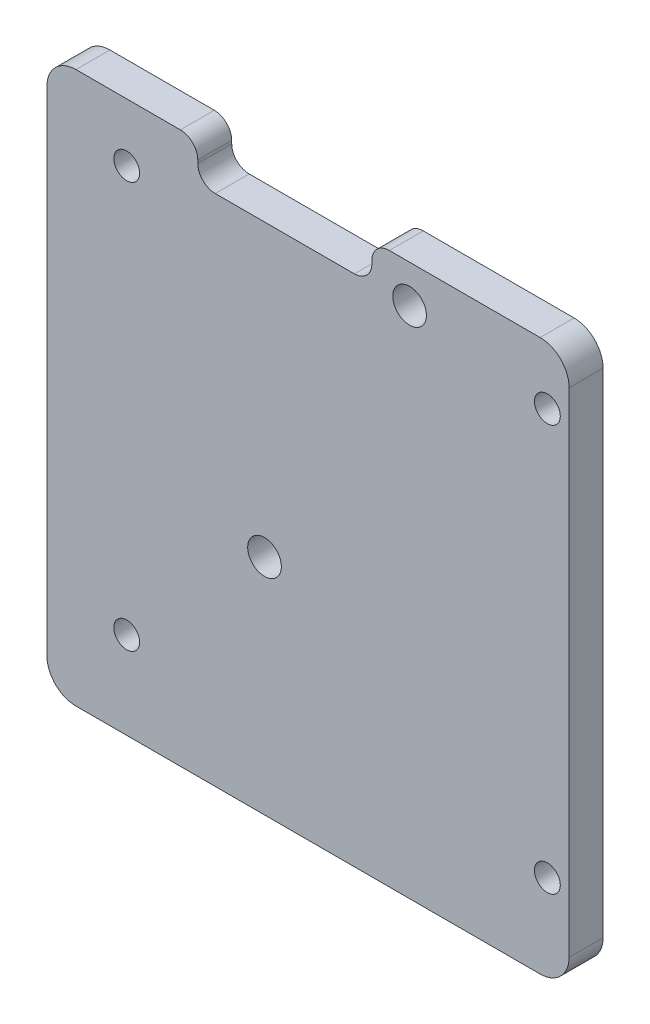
ISO-10303-21;
HEADER;
FILE_DESCRIPTION(('STEP AP214'),'2;1');
FILE_NAME('part.step','',(''),(''),'','','');
FILE_SCHEMA(('AUTOMOTIVE_DESIGN { 1 0 10303 214 1 1 1 1 }'));
ENDSEC;
DATA;
#1=APPLICATION_CONTEXT('core data for automotive mechanical design processes');
#2=APPLICATION_PROTOCOL_DEFINITION('international standard','automotive_design',2000,#1);
#3=PRODUCT_CONTEXT('',#1,'mechanical');
#4=PRODUCT('Part','Part','',(#3));
#5=PRODUCT_RELATED_PRODUCT_CATEGORY('part','',(#4));
#6=PRODUCT_DEFINITION_FORMATION('','',#4);
#7=PRODUCT_DEFINITION_CONTEXT('part definition',#1,'design');
#8=PRODUCT_DEFINITION('design','',#6,#7);
#9=PRODUCT_DEFINITION_SHAPE('','',#8);
#10=(LENGTH_UNIT() NAMED_UNIT(*) SI_UNIT(.MILLI.,.METRE.));
#11=(NAMED_UNIT(*) PLANE_ANGLE_UNIT() SI_UNIT($,.RADIAN.));
#12=(NAMED_UNIT(*) SI_UNIT($,.STERADIAN.) SOLID_ANGLE_UNIT());
#13=UNCERTAINTY_MEASURE_WITH_UNIT(LENGTH_MEASURE(1.E-05),#10,'distance_accuracy_value','');
#14=(GEOMETRIC_REPRESENTATION_CONTEXT(3) GLOBAL_UNCERTAINTY_ASSIGNED_CONTEXT((#13)) GLOBAL_UNIT_ASSIGNED_CONTEXT((#10,
#11,#12)) REPRESENTATION_CONTEXT('',''));
#15=CARTESIAN_POINT('',(0.,0.,0.));
#16=DIRECTION('',(0.,0.,1.));
#17=DIRECTION('',(1.,0.,0.));
#18=AXIS2_PLACEMENT_3D('',#15,#16,#17);
#19=CARTESIAN_POINT('',(-22.86,24.13,2.9718));
#20=DIRECTION('',(0.,-1.,0.));
#21=DIRECTION('',(0.,0.,-1.));
#22=AXIS2_PLACEMENT_3D('',#19,#20,#21);
#23=PLANE('',#22);
#24=DIRECTION('',(-1.,0.,0.));
#25=VECTOR('',#24,1.);
#26=CARTESIAN_POINT('',(-22.86,24.13,0.));
#27=LINE('',#26,#25);
#28=CARTESIAN_POINT('',(-11.176,24.13,0.));
#29=VERTEX_POINT('',#28);
#30=CARTESIAN_POINT('',(-20.32,24.13,0.));
#31=VERTEX_POINT('',#30);
#32=EDGE_CURVE('E163',#29,#31,#27,.T.);
#33=ORIENTED_EDGE('',*,*,#32,.T.);
#34=DIRECTION('',(0.,0.,-1.));
#35=VECTOR('',#34,1.);
#36=CARTESIAN_POINT('',(-20.32,24.13,2.9718));
#37=LINE('',#36,#35);
#38=CARTESIAN_POINT('',(-20.32,24.13,2.9718));
#39=VERTEX_POINT('',#38);
#40=EDGE_CURVE('E47',#31,#39,#37,.F.);
#41=ORIENTED_EDGE('',*,*,#40,.T.);
#42=DIRECTION('',(-1.,0.,0.));
#43=VECTOR('',#42,1.);
#44=CARTESIAN_POINT('',(-22.86,24.13,2.9718));
#45=LINE('',#44,#43);
#46=CARTESIAN_POINT('',(-11.176,24.13,2.9718));
#47=VERTEX_POINT('',#46);
#48=EDGE_CURVE('E248',#47,#39,#45,.T.);
#49=ORIENTED_EDGE('',*,*,#48,.F.);
#50=DIRECTION('',(0.,0.,-1.));
#51=VECTOR('',#50,1.);
#52=CARTESIAN_POINT('',(-11.176,24.13,2.9718));
#53=LINE('',#52,#51);
#54=EDGE_CURVE('E175',#47,#29,#53,.T.);
#55=ORIENTED_EDGE('',*,*,#54,.T.);
#56=EDGE_LOOP('',(#33,#41,#49,#55));
#57=FACE_BOUND('',#56,.T.);
#58=ADVANCED_FACE('F39',(#57),#23,.F.);
#59=CARTESIAN_POINT('',(22.86,24.13,2.9718));
#60=DIRECTION('',(-1.,0.,0.));
#61=DIRECTION('',(0.,-1.,0.));
#62=AXIS2_PLACEMENT_3D('',#59,#60,#61);
#63=PLANE('',#62);
#64=DIRECTION('',(0.,1.,0.));
#65=VECTOR('',#64,1.);
#66=CARTESIAN_POINT('',(22.86,24.13,2.9718));
#67=LINE('',#66,#65);
#68=CARTESIAN_POINT('',(22.86,-21.59,2.9718));
#69=VERTEX_POINT('',#68);
#70=CARTESIAN_POINT('',(22.86,21.59,2.9718));
#71=VERTEX_POINT('',#70);
#72=EDGE_CURVE('E258',#69,#71,#67,.T.);
#73=ORIENTED_EDGE('',*,*,#72,.F.);
#74=DIRECTION('',(0.,0.,-1.));
#75=VECTOR('',#74,1.);
#76=CARTESIAN_POINT('',(22.86,-21.59,2.9718));
#77=LINE('',#76,#75);
#78=CARTESIAN_POINT('',(22.86,-21.59,0.));
#79=VERTEX_POINT('',#78);
#80=EDGE_CURVE('E218',#69,#79,#77,.T.);
#81=ORIENTED_EDGE('',*,*,#80,.T.);
#82=DIRECTION('',(0.,1.,0.));
#83=VECTOR('',#82,1.);
#84=CARTESIAN_POINT('',(22.86,24.13,0.));
#85=LINE('',#84,#83);
#86=CARTESIAN_POINT('',(22.86,21.59,0.));
#87=VERTEX_POINT('',#86);
#88=EDGE_CURVE('E270',#79,#87,#85,.T.);
#89=ORIENTED_EDGE('',*,*,#88,.T.);
#90=DIRECTION('',(0.,0.,-1.));
#91=VECTOR('',#90,1.);
#92=CARTESIAN_POINT('',(22.86,21.59,2.9718));
#93=LINE('',#92,#91);
#94=EDGE_CURVE('E216',#87,#71,#93,.F.);
#95=ORIENTED_EDGE('',*,*,#94,.T.);
#96=EDGE_LOOP('',(#73,#81,#89,#95));
#97=FACE_BOUND('',#96,.T.);
#98=ADVANCED_FACE('F358',(#97),#63,.F.);
#99=CARTESIAN_POINT('',(20.32,24.13,2.9718));
#100=VERTEX_POINT('',#99);
#101=CARTESIAN_POINT('',(7.11200000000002,24.13,2.9718));
#102=VERTEX_POINT('',#101);
#103=EDGE_CURVE('E257',#100,#102,#45,.T.);
#104=ORIENTED_EDGE('',*,*,#103,.F.);
#105=DIRECTION('',(0.,0.,-1.));
#106=VECTOR('',#105,1.);
#107=CARTESIAN_POINT('',(20.32,24.13,2.9718));
#108=LINE('',#107,#106);
#109=CARTESIAN_POINT('',(20.32,24.13,0.));
#110=VERTEX_POINT('',#109);
#111=EDGE_CURVE('E11',#100,#110,#108,.T.);
#112=ORIENTED_EDGE('',*,*,#111,.T.);
#113=CARTESIAN_POINT('',(7.11200000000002,24.13,0.));
#114=VERTEX_POINT('',#113);
#115=EDGE_CURVE('E154',#110,#114,#27,.T.);
#116=ORIENTED_EDGE('',*,*,#115,.T.);
#117=DIRECTION('',(0.,0.,1.));
#118=VECTOR('',#117,1.);
#119=CARTESIAN_POINT('',(7.11200000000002,24.13,2.9718));
#120=LINE('',#119,#118);
#121=EDGE_CURVE('E159',#114,#102,#120,.T.);
#122=ORIENTED_EDGE('',*,*,#121,.T.);
#123=EDGE_LOOP('',(#104,#112,#116,#122));
#124=FACE_BOUND('',#123,.T.);
#125=ADVANCED_FACE('F157',(#124),#23,.F.);
#126=CARTESIAN_POINT('',(-22.86,24.13,2.9718));
#127=DIRECTION('',(1.,0.,0.));
#128=DIRECTION('',(0.,1.,0.));
#129=AXIS2_PLACEMENT_3D('',#126,#127,#128);
#130=PLANE('',#129);
#131=DIRECTION('',(0.,-1.,0.));
#132=VECTOR('',#131,1.);
#133=CARTESIAN_POINT('',(-22.86,24.13,0.));
#134=LINE('',#133,#132);
#135=CARTESIAN_POINT('',(-22.86,21.59,0.));
#136=VERTEX_POINT('',#135);
#137=CARTESIAN_POINT('',(-22.86,-21.59,0.));
#138=VERTEX_POINT('',#137);
#139=EDGE_CURVE('E162',#136,#138,#134,.T.);
#140=ORIENTED_EDGE('',*,*,#139,.T.);
#141=DIRECTION('',(0.,0.,-1.));
#142=VECTOR('',#141,1.);
#143=CARTESIAN_POINT('',(-22.86,-21.59,2.9718));
#144=LINE('',#143,#142);
#145=CARTESIAN_POINT('',(-22.86,-21.59,2.9718));
#146=VERTEX_POINT('',#145);
#147=EDGE_CURVE('E54',#138,#146,#144,.F.);
#148=ORIENTED_EDGE('',*,*,#147,.T.);
#149=DIRECTION('',(0.,-1.,0.));
#150=VECTOR('',#149,1.);
#151=CARTESIAN_POINT('',(-22.86,24.13,2.9718));
#152=LINE('',#151,#150);
#153=CARTESIAN_POINT('',(-22.86,21.59,2.9718));
#154=VERTEX_POINT('',#153);
#155=EDGE_CURVE('E264',#154,#146,#152,.T.);
#156=ORIENTED_EDGE('',*,*,#155,.F.);
#157=DIRECTION('',(0.,0.,-1.));
#158=VECTOR('',#157,1.);
#159=CARTESIAN_POINT('',(-22.86,21.59,2.9718));
#160=LINE('',#159,#158);
#161=EDGE_CURVE('E241',#154,#136,#160,.T.);
#162=ORIENTED_EDGE('',*,*,#161,.T.);
#163=EDGE_LOOP('',(#140,#148,#156,#162));
#164=FACE_BOUND('',#163,.T.);
#165=ADVANCED_FACE('F263',(#164),#130,.F.);
#166=CARTESIAN_POINT('',(-22.86,-24.13,2.9718));
#167=DIRECTION('',(0.,1.,0.));
#168=DIRECTION('',(0.,0.,1.));
#169=AXIS2_PLACEMENT_3D('',#166,#167,#168);
#170=PLANE('',#169);
#171=DIRECTION('',(1.,0.,0.));
#172=VECTOR('',#171,1.);
#173=CARTESIAN_POINT('',(-22.86,-24.13,0.));
#174=LINE('',#173,#172);
#175=CARTESIAN_POINT('',(-20.32,-24.13,0.));
#176=VERTEX_POINT('',#175);
#177=CARTESIAN_POINT('',(20.32,-24.13,0.));
#178=VERTEX_POINT('',#177);
#179=EDGE_CURVE('E266',#176,#178,#174,.T.);
#180=ORIENTED_EDGE('',*,*,#179,.T.);
#181=DIRECTION('',(0.,0.,-1.));
#182=VECTOR('',#181,1.);
#183=CARTESIAN_POINT('',(20.32,-24.13,2.9718));
#184=LINE('',#183,#182);
#185=CARTESIAN_POINT('',(20.32,-24.13,2.9718));
#186=VERTEX_POINT('',#185);
#187=EDGE_CURVE('E232',#178,#186,#184,.F.);
#188=ORIENTED_EDGE('',*,*,#187,.T.);
#189=DIRECTION('',(1.,0.,0.));
#190=VECTOR('',#189,1.);
#191=CARTESIAN_POINT('',(-22.86,-24.13,2.9718));
#192=LINE('',#191,#190);
#193=CARTESIAN_POINT('',(-20.32,-24.13,2.9718));
#194=VERTEX_POINT('',#193);
#195=EDGE_CURVE('E186',#194,#186,#192,.T.);
#196=ORIENTED_EDGE('',*,*,#195,.F.);
#197=DIRECTION('',(0.,0.,-1.));
#198=VECTOR('',#197,1.);
#199=CARTESIAN_POINT('',(-20.32,-24.13,2.9718));
#200=LINE('',#199,#198);
#201=EDGE_CURVE('E229',#194,#176,#200,.T.);
#202=ORIENTED_EDGE('',*,*,#201,.T.);
#203=EDGE_LOOP('',(#180,#188,#196,#202));
#204=FACE_BOUND('',#203,.T.);
#205=ADVANCED_FACE('F331',(#204),#170,.F.);
#206=CARTESIAN_POINT('',(0.,0.,2.9718));
#207=DIRECTION('',(0.,0.,1.));
#208=DIRECTION('',(1.,0.,0.));
#209=AXIS2_PLACEMENT_3D('',#206,#207,#208);
#210=PLANE('',#209);
#211=CARTESIAN_POINT('',(-15.875,19.05,2.9718));
#212=DIRECTION('',(0.,0.,1.));
#213=DIRECTION('',(1.,0.,0.));
#214=AXIS2_PLACEMENT_3D('',#211,#212,#213);
#215=CIRCLE('',#214,1.13029999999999);
#216=CARTESIAN_POINT('',(-14.7447,19.05,2.9718));
#217=VERTEX_POINT('',#216);
#218=EDGE_CURVE('E323',#217,#217,#215,.T.);
#219=ORIENTED_EDGE('',*,*,#218,.F.);
#220=EDGE_LOOP('',(#219));
#221=FACE_BOUND('',#220,.T.);
#222=CARTESIAN_POINT('',(20.955,19.05,2.9718));
#223=DIRECTION('',(0.,0.,1.));
#224=DIRECTION('',(1.,0.,0.));
#225=AXIS2_PLACEMENT_3D('',#222,#223,#224);
#226=CIRCLE('',#225,1.13029999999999);
#227=CARTESIAN_POINT('',(22.0853,19.05,2.9718));
#228=VERTEX_POINT('',#227);
#229=EDGE_CURVE('E317',#228,#228,#226,.T.);
#230=ORIENTED_EDGE('',*,*,#229,.F.);
#231=EDGE_LOOP('',(#230));
#232=FACE_BOUND('',#231,.T.);
#233=CARTESIAN_POINT('',(-15.875,-16.51,2.9718));
#234=DIRECTION('',(0.,0.,1.));
#235=DIRECTION('',(1.,0.,0.));
#236=AXIS2_PLACEMENT_3D('',#233,#234,#235);
#237=CIRCLE('',#236,1.13029999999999);
#238=CARTESIAN_POINT('',(-14.7447,-16.51,2.9718));
#239=VERTEX_POINT('',#238);
#240=EDGE_CURVE('E311',#239,#239,#237,.T.);
#241=ORIENTED_EDGE('',*,*,#240,.F.);
#242=EDGE_LOOP('',(#241));
#243=FACE_BOUND('',#242,.T.);
#244=CARTESIAN_POINT('',(20.955,-16.51,2.9718));
#245=DIRECTION('',(0.,0.,1.));
#246=DIRECTION('',(1.,0.,0.));
#247=AXIS2_PLACEMENT_3D('',#244,#245,#246);
#248=CIRCLE('',#247,1.13029999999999);
#249=CARTESIAN_POINT('',(22.0853,-16.51,2.9718));
#250=VERTEX_POINT('',#249);
#251=EDGE_CURVE('E305',#250,#250,#248,.T.);
#252=ORIENTED_EDGE('',*,*,#251,.F.);
#253=EDGE_LOOP('',(#252));
#254=FACE_BOUND('',#253,.T.);
#255=ORIENTED_EDGE('',*,*,#195,.T.);
#256=CARTESIAN_POINT('',(20.32,-21.59,2.9718));
#257=DIRECTION('',(0.,0.,1.));
#258=DIRECTION('',(1.,0.,0.));
#259=AXIS2_PLACEMENT_3D('',#256,#257,#258);
#260=CIRCLE('',#259,2.54);
#261=EDGE_CURVE('E239',#186,#69,#260,.T.);
#262=ORIENTED_EDGE('',*,*,#261,.T.);
#263=ORIENTED_EDGE('',*,*,#72,.T.);
#264=CARTESIAN_POINT('',(20.32,21.59,2.9718));
#265=DIRECTION('',(0.,0.,1.));
#266=DIRECTION('',(1.,0.,0.));
#267=AXIS2_PLACEMENT_3D('',#264,#265,#266);
#268=CIRCLE('',#267,2.54);
#269=EDGE_CURVE('E234',#71,#100,#268,.T.);
#270=ORIENTED_EDGE('',*,*,#269,.T.);
#271=ORIENTED_EDGE('',*,*,#103,.T.);
#272=CARTESIAN_POINT('',(7.11200000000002,22.606,2.9718));
#273=DIRECTION('',(0.,0.,1.));
#274=DIRECTION('',(1.,0.,0.));
#275=AXIS2_PLACEMENT_3D('',#272,#273,#274);
#276=CIRCLE('',#275,1.524);
#277=CARTESIAN_POINT('',(5.58800000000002,22.606,2.9718));
#278=VERTEX_POINT('',#277);
#279=EDGE_CURVE('E180',#102,#278,#276,.T.);
#280=ORIENTED_EDGE('',*,*,#279,.T.);
#281=DIRECTION('',(0.,1.,0.));
#282=VECTOR('',#281,1.);
#283=CARTESIAN_POINT('',(5.58800000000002,27.432,2.9718));
#284=LINE('',#283,#282);
#285=CARTESIAN_POINT('',(5.58800000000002,22.352,2.9718));
#286=VERTEX_POINT('',#285);
#287=EDGE_CURVE('E289',#286,#278,#284,.T.);
#288=ORIENTED_EDGE('',*,*,#287,.F.);
#289=CARTESIAN_POINT('',(4.06400000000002,22.352,2.9718));
#290=DIRECTION('',(0.,0.,1.));
#291=DIRECTION('',(1.,0.,0.));
#292=AXIS2_PLACEMENT_3D('',#289,#290,#291);
#293=CIRCLE('',#292,1.524);
#294=CARTESIAN_POINT('',(4.06400000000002,20.828,2.9718));
#295=VERTEX_POINT('',#294);
#296=EDGE_CURVE('E212',#286,#295,#293,.F.);
#297=ORIENTED_EDGE('',*,*,#296,.T.);
#298=DIRECTION('',(1.,0.,0.));
#299=VECTOR('',#298,1.);
#300=CARTESIAN_POINT('',(5.58800000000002,20.828,2.9718));
#301=LINE('',#300,#299);
#302=CARTESIAN_POINT('',(-8.12799999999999,20.828,2.9718));
#303=VERTEX_POINT('',#302);
#304=EDGE_CURVE('E293',#303,#295,#301,.T.);
#305=ORIENTED_EDGE('',*,*,#304,.F.);
#306=CARTESIAN_POINT('',(-8.12799999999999,22.352,2.9718));
#307=DIRECTION('',(0.,0.,1.));
#308=DIRECTION('',(1.,0.,0.));
#309=AXIS2_PLACEMENT_3D('',#306,#307,#308);
#310=CIRCLE('',#309,1.524);
#311=CARTESIAN_POINT('',(-9.65199999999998,22.352,2.9718));
#312=VERTEX_POINT('',#311);
#313=EDGE_CURVE('E208',#303,#312,#310,.F.);
#314=ORIENTED_EDGE('',*,*,#313,.T.);
#315=DIRECTION('',(0.,-1.,0.));
#316=VECTOR('',#315,1.);
#317=CARTESIAN_POINT('',(-9.65199999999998,27.432,2.9718));
#318=LINE('',#317,#316);
#319=CARTESIAN_POINT('',(-9.65199999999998,22.606,2.9718));
#320=VERTEX_POINT('',#319);
#321=EDGE_CURVE('E296',#320,#312,#318,.T.);
#322=ORIENTED_EDGE('',*,*,#321,.F.);
#323=CARTESIAN_POINT('',(-11.176,22.606,2.9718));
#324=DIRECTION('',(0.,0.,1.));
#325=DIRECTION('',(1.,0.,0.));
#326=AXIS2_PLACEMENT_3D('',#323,#324,#325);
#327=CIRCLE('',#326,1.524);
#328=EDGE_CURVE('E181',#320,#47,#327,.T.);
#329=ORIENTED_EDGE('',*,*,#328,.T.);
#330=ORIENTED_EDGE('',*,*,#48,.T.);
#331=CARTESIAN_POINT('',(-20.32,21.59,2.9718));
#332=DIRECTION('',(0.,0.,1.));
#333=DIRECTION('',(1.,0.,0.));
#334=AXIS2_PLACEMENT_3D('',#331,#332,#333);
#335=CIRCLE('',#334,2.54);
#336=EDGE_CURVE('E61',#39,#154,#335,.T.);
#337=ORIENTED_EDGE('',*,*,#336,.T.);
#338=ORIENTED_EDGE('',*,*,#155,.T.);
#339=CARTESIAN_POINT('',(-20.32,-21.59,2.9718));
#340=DIRECTION('',(0.,0.,1.));
#341=DIRECTION('',(1.,0.,0.));
#342=AXIS2_PLACEMENT_3D('',#339,#340,#341);
#343=CIRCLE('',#342,2.54);
#344=EDGE_CURVE('E237',#146,#194,#343,.T.);
#345=ORIENTED_EDGE('',*,*,#344,.T.);
#346=EDGE_LOOP('',(#255,#262,#263,#270,#271,#280,#288,#297,#305,#314,#322,#329,#330,#337,#338,#345));
#347=FACE_BOUND('',#346,.T.);
#348=CARTESIAN_POINT('',(8.89,20.828,2.9718));
#349=DIRECTION('',(0.,0.,1.));
#350=DIRECTION('',(1.,0.,0.));
#351=AXIS2_PLACEMENT_3D('',#348,#349,#350);
#352=CIRCLE('',#351,1.4732);
#353=CARTESIAN_POINT('',(10.3632,20.828,2.9718));
#354=VERTEX_POINT('',#353);
#355=EDGE_CURVE('E286',#354,#354,#352,.T.);
#356=ORIENTED_EDGE('',*,*,#355,.F.);
#357=EDGE_LOOP('',(#356));
#358=FACE_BOUND('',#357,.T.);
#359=CARTESIAN_POINT('',(-3.80999999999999,-4.572,2.9718));
#360=DIRECTION('',(0.,0.,1.));
#361=DIRECTION('',(1.,0.,0.));
#362=AXIS2_PLACEMENT_3D('',#359,#360,#361);
#363=CIRCLE('',#362,1.4732);
#364=CARTESIAN_POINT('',(-2.33679999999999,-4.572,2.9718));
#365=VERTEX_POINT('',#364);
#366=EDGE_CURVE('E280',#365,#365,#363,.T.);
#367=ORIENTED_EDGE('',*,*,#366,.F.);
#368=EDGE_LOOP('',(#367));
#369=FACE_BOUND('',#368,.T.);
#370=ADVANCED_FACE('F253',(#221,#232,#243,#254,#347,#358,#369),#210,.T.);
#371=CARTESIAN_POINT('',(0.,0.,0.));
#372=DIRECTION('',(0.,0.,1.));
#373=DIRECTION('',(1.,0.,0.));
#374=AXIS2_PLACEMENT_3D('',#371,#372,#373);
#375=PLANE('',#374);
#376=CARTESIAN_POINT('',(-15.875,19.05,0.));
#377=DIRECTION('',(0.,0.,1.));
#378=DIRECTION('',(1.,0.,0.));
#379=AXIS2_PLACEMENT_3D('',#376,#377,#378);
#380=CIRCLE('',#379,1.1303);
#381=CARTESIAN_POINT('',(-14.7447,19.05,0.));
#382=VERTEX_POINT('',#381);
#383=EDGE_CURVE('E320',#382,#382,#380,.T.);
#384=ORIENTED_EDGE('',*,*,#383,.T.);
#385=EDGE_LOOP('',(#384));
#386=FACE_BOUND('',#385,.T.);
#387=CARTESIAN_POINT('',(20.955,19.05,0.));
#388=DIRECTION('',(0.,0.,1.));
#389=DIRECTION('',(1.,0.,0.));
#390=AXIS2_PLACEMENT_3D('',#387,#388,#389);
#391=CIRCLE('',#390,1.1303);
#392=CARTESIAN_POINT('',(22.0853,19.05,0.));
#393=VERTEX_POINT('',#392);
#394=EDGE_CURVE('E314',#393,#393,#391,.T.);
#395=ORIENTED_EDGE('',*,*,#394,.T.);
#396=EDGE_LOOP('',(#395));
#397=FACE_BOUND('',#396,.T.);
#398=CARTESIAN_POINT('',(-15.875,-16.51,0.));
#399=DIRECTION('',(0.,0.,1.));
#400=DIRECTION('',(1.,0.,0.));
#401=AXIS2_PLACEMENT_3D('',#398,#399,#400);
#402=CIRCLE('',#401,1.1303);
#403=CARTESIAN_POINT('',(-14.7447,-16.51,0.));
#404=VERTEX_POINT('',#403);
#405=EDGE_CURVE('E308',#404,#404,#402,.T.);
#406=ORIENTED_EDGE('',*,*,#405,.T.);
#407=EDGE_LOOP('',(#406));
#408=FACE_BOUND('',#407,.T.);
#409=CARTESIAN_POINT('',(20.955,-16.51,0.));
#410=DIRECTION('',(0.,0.,1.));
#411=DIRECTION('',(1.,0.,0.));
#412=AXIS2_PLACEMENT_3D('',#409,#410,#411);
#413=CIRCLE('',#412,1.1303);
#414=CARTESIAN_POINT('',(22.0853,-16.51,0.));
#415=VERTEX_POINT('',#414);
#416=EDGE_CURVE('E299',#415,#415,#413,.T.);
#417=ORIENTED_EDGE('',*,*,#416,.T.);
#418=EDGE_LOOP('',(#417));
#419=FACE_BOUND('',#418,.T.);
#420=ORIENTED_EDGE('',*,*,#88,.F.);
#421=CARTESIAN_POINT('',(20.32,-21.59,0.));
#422=DIRECTION('',(0.,0.,1.));
#423=DIRECTION('',(1.,0.,0.));
#424=AXIS2_PLACEMENT_3D('',#421,#422,#423);
#425=CIRCLE('',#424,2.54);
#426=EDGE_CURVE('E227',#79,#178,#425,.F.);
#427=ORIENTED_EDGE('',*,*,#426,.T.);
#428=ORIENTED_EDGE('',*,*,#179,.F.);
#429=CARTESIAN_POINT('',(-20.32,-21.59,0.));
#430=DIRECTION('',(0.,0.,1.));
#431=DIRECTION('',(1.,0.,0.));
#432=AXIS2_PLACEMENT_3D('',#429,#430,#431);
#433=CIRCLE('',#432,2.54);
#434=EDGE_CURVE('E225',#176,#138,#433,.F.);
#435=ORIENTED_EDGE('',*,*,#434,.T.);
#436=ORIENTED_EDGE('',*,*,#139,.F.);
#437=CARTESIAN_POINT('',(-20.32,21.59,0.));
#438=DIRECTION('',(0.,0.,1.));
#439=DIRECTION('',(1.,0.,0.));
#440=AXIS2_PLACEMENT_3D('',#437,#438,#439);
#441=CIRCLE('',#440,2.54);
#442=EDGE_CURVE('E223',#136,#31,#441,.F.);
#443=ORIENTED_EDGE('',*,*,#442,.T.);
#444=ORIENTED_EDGE('',*,*,#32,.F.);
#445=CARTESIAN_POINT('',(-11.176,22.606,0.));
#446=DIRECTION('',(0.,0.,1.));
#447=DIRECTION('',(1.,0.,0.));
#448=AXIS2_PLACEMENT_3D('',#445,#446,#447);
#449=CIRCLE('',#448,1.524);
#450=CARTESIAN_POINT('',(-9.65199999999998,22.606,0.));
#451=VERTEX_POINT('',#450);
#452=EDGE_CURVE('E176',#29,#451,#449,.F.);
#453=ORIENTED_EDGE('',*,*,#452,.T.);
#454=DIRECTION('',(0.,-1.,0.));
#455=VECTOR('',#454,1.);
#456=CARTESIAN_POINT('',(-9.65199999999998,0.,0.));
#457=LINE('',#456,#455);
#458=CARTESIAN_POINT('',(-9.65199999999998,22.352,0.));
#459=VERTEX_POINT('',#458);
#460=EDGE_CURVE('E182',#451,#459,#457,.T.);
#461=ORIENTED_EDGE('',*,*,#460,.T.);
#462=CARTESIAN_POINT('',(-8.12799999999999,22.352,0.));
#463=DIRECTION('',(0.,0.,1.));
#464=DIRECTION('',(1.,0.,0.));
#465=AXIS2_PLACEMENT_3D('',#462,#463,#464);
#466=CIRCLE('',#465,1.524);
#467=CARTESIAN_POINT('',(-8.12799999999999,20.828,0.));
#468=VERTEX_POINT('',#467);
#469=EDGE_CURVE('E210',#459,#468,#466,.T.);
#470=ORIENTED_EDGE('',*,*,#469,.T.);
#471=DIRECTION('',(1.,0.,0.));
#472=VECTOR('',#471,1.);
#473=CARTESIAN_POINT('',(5.58800000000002,20.828,0.));
#474=LINE('',#473,#472);
#475=CARTESIAN_POINT('',(4.06400000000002,20.828,0.));
#476=VERTEX_POINT('',#475);
#477=EDGE_CURVE('E292',#468,#476,#474,.T.);
#478=ORIENTED_EDGE('',*,*,#477,.T.);
#479=CARTESIAN_POINT('',(4.06400000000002,22.352,0.));
#480=DIRECTION('',(0.,0.,1.));
#481=DIRECTION('',(1.,0.,0.));
#482=AXIS2_PLACEMENT_3D('',#479,#480,#481);
#483=CIRCLE('',#482,1.524);
#484=CARTESIAN_POINT('',(5.58800000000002,22.352,0.));
#485=VERTEX_POINT('',#484);
#486=EDGE_CURVE('E214',#476,#485,#483,.T.);
#487=ORIENTED_EDGE('',*,*,#486,.T.);
#488=DIRECTION('',(0.,1.,0.));
#489=VECTOR('',#488,1.);
#490=CARTESIAN_POINT('',(5.58800000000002,27.432,0.));
#491=LINE('',#490,#489);
#492=CARTESIAN_POINT('',(5.58800000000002,22.606,0.));
#493=VERTEX_POINT('',#492);
#494=EDGE_CURVE('E172',#485,#493,#491,.T.);
#495=ORIENTED_EDGE('',*,*,#494,.T.);
#496=CARTESIAN_POINT('',(7.11200000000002,22.606,0.));
#497=DIRECTION('',(0.,0.,1.));
#498=DIRECTION('',(1.,0.,0.));
#499=AXIS2_PLACEMENT_3D('',#496,#497,#498);
#500=CIRCLE('',#499,1.524);
#501=EDGE_CURVE('E167',#493,#114,#500,.F.);
#502=ORIENTED_EDGE('',*,*,#501,.T.);
#503=ORIENTED_EDGE('',*,*,#115,.F.);
#504=CARTESIAN_POINT('',(20.32,21.59,0.));
#505=DIRECTION('',(0.,0.,1.));
#506=DIRECTION('',(1.,0.,0.));
#507=AXIS2_PLACEMENT_3D('',#504,#505,#506);
#508=CIRCLE('',#507,2.54);
#509=EDGE_CURVE('E221',#110,#87,#508,.F.);
#510=ORIENTED_EDGE('',*,*,#509,.T.);
#511=EDGE_LOOP('',(#420,#427,#428,#435,#436,#443,#444,#453,#461,#470,#478,#487,#495,#502,#503,#510));
#512=FACE_BOUND('',#511,.T.);
#513=CARTESIAN_POINT('',(8.89,20.828,0.));
#514=DIRECTION('',(0.,0.,1.));
#515=DIRECTION('',(1.,0.,0.));
#516=AXIS2_PLACEMENT_3D('',#513,#514,#515);
#517=CIRCLE('',#516,1.4732);
#518=CARTESIAN_POINT('',(10.3632,20.828,0.));
#519=VERTEX_POINT('',#518);
#520=EDGE_CURVE('E283',#519,#519,#517,.T.);
#521=ORIENTED_EDGE('',*,*,#520,.T.);
#522=EDGE_LOOP('',(#521));
#523=FACE_BOUND('',#522,.T.);
#524=CARTESIAN_POINT('',(-3.80999999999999,-4.572,0.));
#525=DIRECTION('',(0.,0.,1.));
#526=DIRECTION('',(1.,0.,0.));
#527=AXIS2_PLACEMENT_3D('',#524,#525,#526);
#528=CIRCLE('',#527,1.4732);
#529=CARTESIAN_POINT('',(-2.33679999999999,-4.572,0.));
#530=VERTEX_POINT('',#529);
#531=EDGE_CURVE('E273',#530,#530,#528,.T.);
#532=ORIENTED_EDGE('',*,*,#531,.T.);
#533=EDGE_LOOP('',(#532));
#534=FACE_BOUND('',#533,.T.);
#535=ADVANCED_FACE('F169',(#386,#397,#408,#419,#512,#523,#534),#375,.F.);
#536=CARTESIAN_POINT('',(-3.80999999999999,-4.572,2.9718));
#537=DIRECTION('',(0.,0.,1.));
#538=DIRECTION('',(1.,0.,0.));
#539=AXIS2_PLACEMENT_3D('',#536,#537,#538);
#540=CYLINDRICAL_SURFACE('',#539,1.4732);
#541=ORIENTED_EDGE('',*,*,#531,.F.);
#542=EDGE_LOOP('',(#541));
#543=FACE_BOUND('',#542,.T.);
#544=ORIENTED_EDGE('',*,*,#366,.T.);
#545=EDGE_LOOP('',(#544));
#546=FACE_BOUND('',#545,.T.);
#547=ADVANCED_FACE('F377',(#543,#546),#540,.F.);
#548=CARTESIAN_POINT('',(8.89,20.828,2.9718));
#549=DIRECTION('',(0.,0.,1.));
#550=DIRECTION('',(1.,0.,0.));
#551=AXIS2_PLACEMENT_3D('',#548,#549,#550);
#552=CYLINDRICAL_SURFACE('',#551,1.4732);
#553=ORIENTED_EDGE('',*,*,#520,.F.);
#554=EDGE_LOOP('',(#553));
#555=FACE_BOUND('',#554,.T.);
#556=ORIENTED_EDGE('',*,*,#355,.T.);
#557=EDGE_LOOP('',(#556));
#558=FACE_BOUND('',#557,.T.);
#559=ADVANCED_FACE('F382',(#555,#558),#552,.F.);
#560=CARTESIAN_POINT('',(-9.65199999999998,27.432,0.));
#561=DIRECTION('',(-1.,0.,0.));
#562=DIRECTION('',(0.,0.,1.));
#563=AXIS2_PLACEMENT_3D('',#560,#561,#562);
#564=PLANE('',#563);
#565=ORIENTED_EDGE('',*,*,#460,.F.);
#566=DIRECTION('',(0.,0.,-1.));
#567=VECTOR('',#566,1.);
#568=CARTESIAN_POINT('',(-9.65199999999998,22.606,0.));
#569=LINE('',#568,#567);
#570=EDGE_CURVE('E201',#451,#320,#569,.F.);
#571=ORIENTED_EDGE('',*,*,#570,.T.);
#572=ORIENTED_EDGE('',*,*,#321,.T.);
#573=DIRECTION('',(0.,0.,1.));
#574=VECTOR('',#573,1.);
#575=CARTESIAN_POINT('',(-9.65199999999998,22.352,0.));
#576=LINE('',#575,#574);
#577=EDGE_CURVE('E199',#312,#459,#576,.F.);
#578=ORIENTED_EDGE('',*,*,#577,.T.);
#579=EDGE_LOOP('',(#565,#571,#572,#578));
#580=FACE_BOUND('',#579,.T.);
#581=ADVANCED_FACE('F386',(#580),#564,.F.);
#582=CARTESIAN_POINT('',(5.58800000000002,27.432,0.));
#583=DIRECTION('',(1.,0.,0.));
#584=DIRECTION('',(0.,1.,0.));
#585=AXIS2_PLACEMENT_3D('',#582,#583,#584);
#586=PLANE('',#585);
#587=ORIENTED_EDGE('',*,*,#287,.T.);
#588=DIRECTION('',(0.,0.,1.));
#589=VECTOR('',#588,1.);
#590=CARTESIAN_POINT('',(5.58800000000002,22.606,0.));
#591=LINE('',#590,#589);
#592=EDGE_CURVE('E194',#278,#493,#591,.F.);
#593=ORIENTED_EDGE('',*,*,#592,.T.);
#594=ORIENTED_EDGE('',*,*,#494,.F.);
#595=DIRECTION('',(0.,0.,1.));
#596=VECTOR('',#595,1.);
#597=CARTESIAN_POINT('',(5.58800000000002,22.352,2.9718));
#598=LINE('',#597,#596);
#599=EDGE_CURVE('E191',#485,#286,#598,.T.);
#600=ORIENTED_EDGE('',*,*,#599,.T.);
#601=EDGE_LOOP('',(#587,#593,#594,#600));
#602=FACE_BOUND('',#601,.T.);
#603=ADVANCED_FACE('F390',(#602),#586,.F.);
#604=CARTESIAN_POINT('',(5.58800000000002,20.828,0.));
#605=DIRECTION('',(0.,-1.,0.));
#606=DIRECTION('',(1.,0.,0.));
#607=AXIS2_PLACEMENT_3D('',#604,#605,#606);
#608=PLANE('',#607);
#609=ORIENTED_EDGE('',*,*,#477,.F.);
#610=DIRECTION('',(0.,0.,1.));
#611=VECTOR('',#610,1.);
#612=CARTESIAN_POINT('',(-8.12799999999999,20.828,2.9718));
#613=LINE('',#612,#611);
#614=EDGE_CURVE('E205',#468,#303,#613,.T.);
#615=ORIENTED_EDGE('',*,*,#614,.T.);
#616=ORIENTED_EDGE('',*,*,#304,.T.);
#617=DIRECTION('',(0.,0.,1.));
#618=VECTOR('',#617,1.);
#619=CARTESIAN_POINT('',(4.06400000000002,20.828,0.));
#620=LINE('',#619,#618);
#621=EDGE_CURVE('E203',#295,#476,#620,.F.);
#622=ORIENTED_EDGE('',*,*,#621,.T.);
#623=EDGE_LOOP('',(#609,#615,#616,#622));
#624=FACE_BOUND('',#623,.T.);
#625=ADVANCED_FACE('F392',(#624),#608,.F.);
#626=CARTESIAN_POINT('',(7.11200000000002,22.606,2.9718));
#627=DIRECTION('',(0.,0.,1.));
#628=DIRECTION('',(1.,0.,0.));
#629=AXIS2_PLACEMENT_3D('',#626,#627,#628);
#630=CYLINDRICAL_SURFACE('',#629,1.524);
#631=ORIENTED_EDGE('',*,*,#501,.F.);
#632=ORIENTED_EDGE('',*,*,#592,.F.);
#633=ORIENTED_EDGE('',*,*,#279,.F.);
#634=ORIENTED_EDGE('',*,*,#121,.F.);
#635=EDGE_LOOP('',(#631,#632,#633,#634));
#636=FACE_BOUND('',#635,.T.);
#637=ADVANCED_FACE('F179',(#636),#630,.T.);
#638=CARTESIAN_POINT('',(-11.176,22.606,2.9718));
#639=DIRECTION('',(0.,0.,-1.));
#640=DIRECTION('',(-1.,0.,0.));
#641=AXIS2_PLACEMENT_3D('',#638,#639,#640);
#642=CYLINDRICAL_SURFACE('',#641,1.524);
#643=ORIENTED_EDGE('',*,*,#328,.F.);
#644=ORIENTED_EDGE('',*,*,#570,.F.);
#645=ORIENTED_EDGE('',*,*,#452,.F.);
#646=ORIENTED_EDGE('',*,*,#54,.F.);
#647=EDGE_LOOP('',(#643,#644,#645,#646));
#648=FACE_BOUND('',#647,.T.);
#649=ADVANCED_FACE('F426',(#648),#642,.T.);
#650=CARTESIAN_POINT('',(-8.12799999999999,22.352,0.));
#651=DIRECTION('',(0.,0.,-1.));
#652=DIRECTION('',(-1.,0.,0.));
#653=AXIS2_PLACEMENT_3D('',#650,#651,#652);
#654=CYLINDRICAL_SURFACE('',#653,1.524);
#655=ORIENTED_EDGE('',*,*,#469,.F.);
#656=ORIENTED_EDGE('',*,*,#577,.F.);
#657=ORIENTED_EDGE('',*,*,#313,.F.);
#658=ORIENTED_EDGE('',*,*,#614,.F.);
#659=EDGE_LOOP('',(#655,#656,#657,#658));
#660=FACE_BOUND('',#659,.T.);
#661=ADVANCED_FACE('F352',(#660),#654,.F.);
#662=CARTESIAN_POINT('',(4.06400000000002,22.352,0.));
#663=DIRECTION('',(0.,0.,-1.));
#664=DIRECTION('',(-1.,0.,0.));
#665=AXIS2_PLACEMENT_3D('',#662,#663,#664);
#666=CYLINDRICAL_SURFACE('',#665,1.524);
#667=ORIENTED_EDGE('',*,*,#486,.F.);
#668=ORIENTED_EDGE('',*,*,#621,.F.);
#669=ORIENTED_EDGE('',*,*,#296,.F.);
#670=ORIENTED_EDGE('',*,*,#599,.F.);
#671=EDGE_LOOP('',(#667,#668,#669,#670));
#672=FACE_BOUND('',#671,.T.);
#673=ADVANCED_FACE('F342',(#672),#666,.F.);
#674=CARTESIAN_POINT('',(20.955,-16.51,2.9718));
#675=DIRECTION('',(0.,0.,1.));
#676=DIRECTION('',(1.,0.,0.));
#677=AXIS2_PLACEMENT_3D('',#674,#675,#676);
#678=CYLINDRICAL_SURFACE('',#677,1.13029999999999);
#679=ORIENTED_EDGE('',*,*,#416,.F.);
#680=EDGE_LOOP('',(#679));
#681=FACE_BOUND('',#680,.T.);
#682=ORIENTED_EDGE('',*,*,#251,.T.);
#683=EDGE_LOOP('',(#682));
#684=FACE_BOUND('',#683,.T.);
#685=ADVANCED_FACE('F339',(#681,#684),#678,.F.);
#686=CARTESIAN_POINT('',(-15.875,-16.51,2.9718));
#687=DIRECTION('',(0.,0.,1.));
#688=DIRECTION('',(1.,0.,0.));
#689=AXIS2_PLACEMENT_3D('',#686,#687,#688);
#690=CYLINDRICAL_SURFACE('',#689,1.13029999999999);
#691=ORIENTED_EDGE('',*,*,#405,.F.);
#692=EDGE_LOOP('',(#691));
#693=FACE_BOUND('',#692,.T.);
#694=ORIENTED_EDGE('',*,*,#240,.T.);
#695=EDGE_LOOP('',(#694));
#696=FACE_BOUND('',#695,.T.);
#697=ADVANCED_FACE('F341',(#693,#696),#690,.F.);
#698=CARTESIAN_POINT('',(20.955,19.05,2.9718));
#699=DIRECTION('',(0.,0.,1.));
#700=DIRECTION('',(1.,0.,0.));
#701=AXIS2_PLACEMENT_3D('',#698,#699,#700);
#702=CYLINDRICAL_SURFACE('',#701,1.13029999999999);
#703=ORIENTED_EDGE('',*,*,#394,.F.);
#704=EDGE_LOOP('',(#703));
#705=FACE_BOUND('',#704,.T.);
#706=ORIENTED_EDGE('',*,*,#229,.T.);
#707=EDGE_LOOP('',(#706));
#708=FACE_BOUND('',#707,.T.);
#709=ADVANCED_FACE('F349',(#705,#708),#702,.F.);
#710=CARTESIAN_POINT('',(-15.875,19.05,2.9718));
#711=DIRECTION('',(0.,0.,1.));
#712=DIRECTION('',(1.,0.,0.));
#713=AXIS2_PLACEMENT_3D('',#710,#711,#712);
#714=CYLINDRICAL_SURFACE('',#713,1.13029999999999);
#715=ORIENTED_EDGE('',*,*,#383,.F.);
#716=EDGE_LOOP('',(#715));
#717=FACE_BOUND('',#716,.T.);
#718=ORIENTED_EDGE('',*,*,#218,.T.);
#719=EDGE_LOOP('',(#718));
#720=FACE_BOUND('',#719,.T.);
#721=ADVANCED_FACE('F327',(#717,#720),#714,.F.);
#722=CARTESIAN_POINT('',(20.32,-21.59,2.9718));
#723=DIRECTION('',(0.,0.,-1.));
#724=DIRECTION('',(-1.,0.,0.));
#725=AXIS2_PLACEMENT_3D('',#722,#723,#724);
#726=CYLINDRICAL_SURFACE('',#725,2.54);
#727=ORIENTED_EDGE('',*,*,#261,.F.);
#728=ORIENTED_EDGE('',*,*,#187,.F.);
#729=ORIENTED_EDGE('',*,*,#426,.F.);
#730=ORIENTED_EDGE('',*,*,#80,.F.);
#731=EDGE_LOOP('',(#727,#728,#729,#730));
#732=FACE_BOUND('',#731,.T.);
#733=ADVANCED_FACE('F409',(#732),#726,.T.);
#734=CARTESIAN_POINT('',(-20.32,-21.59,2.9718));
#735=DIRECTION('',(0.,0.,-1.));
#736=DIRECTION('',(-1.,0.,0.));
#737=AXIS2_PLACEMENT_3D('',#734,#735,#736);
#738=CYLINDRICAL_SURFACE('',#737,2.54);
#739=ORIENTED_EDGE('',*,*,#344,.F.);
#740=ORIENTED_EDGE('',*,*,#147,.F.);
#741=ORIENTED_EDGE('',*,*,#434,.F.);
#742=ORIENTED_EDGE('',*,*,#201,.F.);
#743=EDGE_LOOP('',(#739,#740,#741,#742));
#744=FACE_BOUND('',#743,.T.);
#745=ADVANCED_FACE('F415',(#744),#738,.T.);
#746=CARTESIAN_POINT('',(-20.32,21.59,2.9718));
#747=DIRECTION('',(0.,0.,-1.));
#748=DIRECTION('',(-1.,0.,0.));
#749=AXIS2_PLACEMENT_3D('',#746,#747,#748);
#750=CYLINDRICAL_SURFACE('',#749,2.54);
#751=ORIENTED_EDGE('',*,*,#336,.F.);
#752=ORIENTED_EDGE('',*,*,#40,.F.);
#753=ORIENTED_EDGE('',*,*,#442,.F.);
#754=ORIENTED_EDGE('',*,*,#161,.F.);
#755=EDGE_LOOP('',(#751,#752,#753,#754));
#756=FACE_BOUND('',#755,.T.);
#757=ADVANCED_FACE('F261',(#756),#750,.T.);
#758=CARTESIAN_POINT('',(20.32,21.59,2.9718));
#759=DIRECTION('',(0.,0.,-1.));
#760=DIRECTION('',(-1.,0.,0.));
#761=AXIS2_PLACEMENT_3D('',#758,#759,#760);
#762=CYLINDRICAL_SURFACE('',#761,2.54);
#763=ORIENTED_EDGE('',*,*,#269,.F.);
#764=ORIENTED_EDGE('',*,*,#94,.F.);
#765=ORIENTED_EDGE('',*,*,#509,.F.);
#766=ORIENTED_EDGE('',*,*,#111,.F.);
#767=EDGE_LOOP('',(#763,#764,#765,#766));
#768=FACE_BOUND('',#767,.T.);
#769=ADVANCED_FACE('F41',(#768),#762,.T.);
#770=CLOSED_SHELL('',(#58,#98,#125,#165,#205,#370,#535,#547,#559,#581,#603,#625,#637,#649,#661,
#673,#685,#697,#709,#721,#733,#745,#757,#769));
#771=MANIFOLD_SOLID_BREP('B2',#770);
#772=ADVANCED_BREP_SHAPE_REPRESENTATION('',(#18,#771),#14);
#773=SHAPE_DEFINITION_REPRESENTATION(#9,#772);
ENDSEC;
END-ISO-10303-21;
